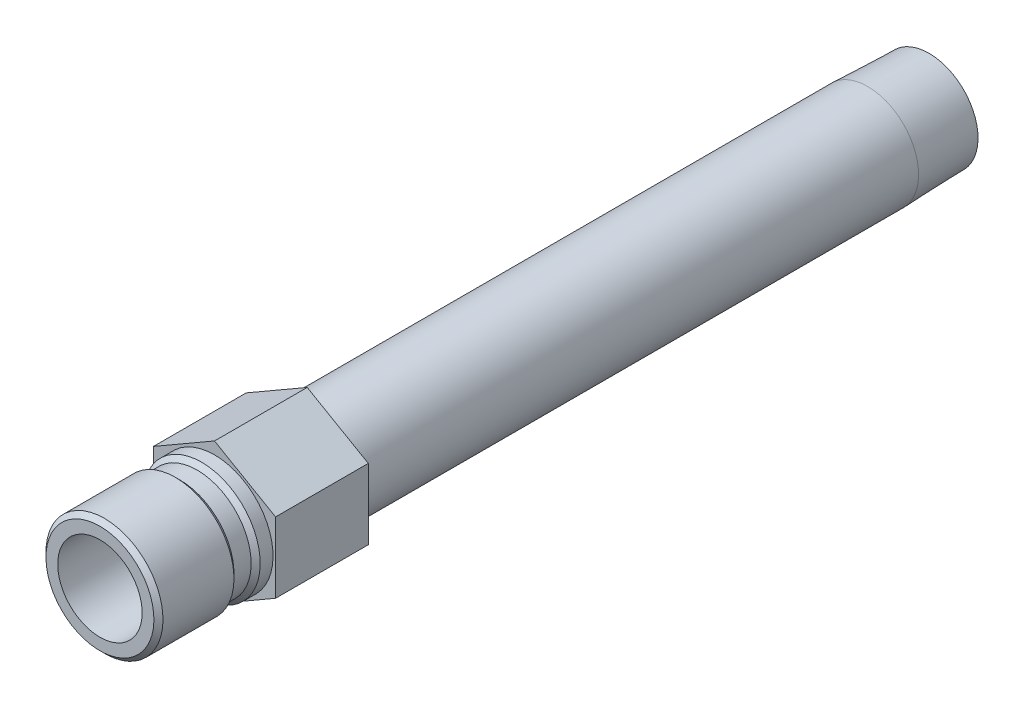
from build123d import *

# Parameters (mm, degrees)
SKETCH2_R           = 7.112
BOSS_EXTRUDE1_DEPTH = 15.621


with BuildPart() as part:
    # Sketch1 → Revolve1 (revolve)
    with BuildSketch(Plane(origin=(0, 0, 0), x_dir=(0, 0, -1), z_dir=(1, 0, 0))):
        Polygon((-19.304, 7.112), (-19.304, 9.0932), (-18.542, 9.8552), (-6.5786, 9.8552), (-5.8166, 9.0932), (-2.921, 9.0932), (-2.159, 9.8552), (0, 9.8552), (0, 8.5725), (110.0582, 8.5725), (120.396, 8.249445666), (120.396, 6.2611), (-1.071568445, 6.2611), (-1.524, 7.112), align=None)
    revolve(axis=Axis((0, 0, 0), (0, 0, 1)))

    # Sketch2 → Boss-Extrude1 (add)
    with BuildSketch(Plane.XY):
        Polygon((-10.287, 5.939202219), (-10.287, -5.939202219), (0, -11.878404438), (10.287, -5.939202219), (10.287, 5.939202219), (0, 11.878404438), align=None)
        with Locations(Location((0, 0, 0), (0, 0, 90))):
            Circle(SKETCH2_R, mode=Mode.SUBTRACT)
    extrude(amount=-BOSS_EXTRUDE1_DEPTH)


solid = part.part
